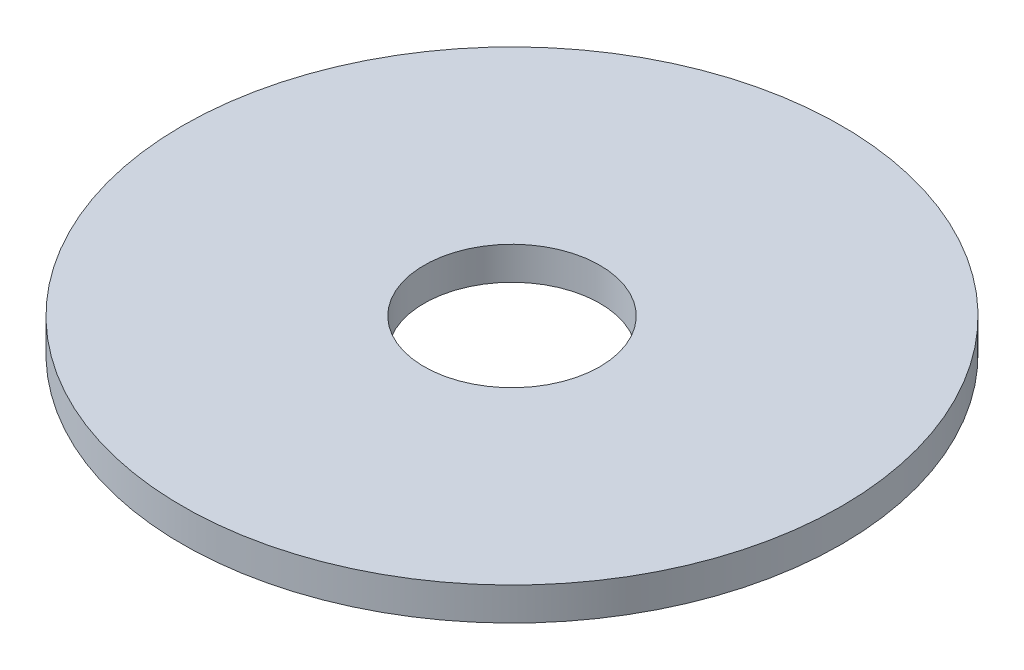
ISO-10303-21;
HEADER;
FILE_DESCRIPTION(('STEP AP214'),'2;1');
FILE_NAME('part.step','',(''),(''),'','','');
FILE_SCHEMA(('AUTOMOTIVE_DESIGN { 1 0 10303 214 1 1 1 1 }'));
ENDSEC;
DATA;
#1=APPLICATION_CONTEXT('core data for automotive mechanical design processes');
#2=APPLICATION_PROTOCOL_DEFINITION('international standard','automotive_design',2000,#1);
#3=PRODUCT_CONTEXT('',#1,'mechanical');
#4=PRODUCT('Part','Part','',(#3));
#5=PRODUCT_RELATED_PRODUCT_CATEGORY('part','',(#4));
#6=PRODUCT_DEFINITION_FORMATION('','',#4);
#7=PRODUCT_DEFINITION_CONTEXT('part definition',#1,'design');
#8=PRODUCT_DEFINITION('design','',#6,#7);
#9=PRODUCT_DEFINITION_SHAPE('','',#8);
#10=(LENGTH_UNIT() NAMED_UNIT(*) SI_UNIT(.MILLI.,.METRE.));
#11=(NAMED_UNIT(*) PLANE_ANGLE_UNIT() SI_UNIT($,.RADIAN.));
#12=(NAMED_UNIT(*) SI_UNIT($,.STERADIAN.) SOLID_ANGLE_UNIT());
#13=UNCERTAINTY_MEASURE_WITH_UNIT(LENGTH_MEASURE(1.E-05),#10,'distance_accuracy_value','');
#14=(GEOMETRIC_REPRESENTATION_CONTEXT(3) GLOBAL_UNCERTAINTY_ASSIGNED_CONTEXT((#13)) GLOBAL_UNIT_ASSIGNED_CONTEXT((#10,
#11,#12)) REPRESENTATION_CONTEXT('',''));
#15=CARTESIAN_POINT('',(0.,0.,0.));
#16=DIRECTION('',(0.,0.,1.));
#17=DIRECTION('',(1.,0.,0.));
#18=AXIS2_PLACEMENT_3D('',#15,#16,#17);
#19=CARTESIAN_POINT('',(-12.,0.,0.));
#20=DIRECTION('',(0.,-1.,0.));
#21=DIRECTION('',(1.,0.,0.));
#22=AXIS2_PLACEMENT_3D('',#19,#20,#21);
#23=PLANE('',#22);
#24=CARTESIAN_POINT('',(0.,0.,0.));
#25=DIRECTION('',(0.,-1.,0.));
#26=DIRECTION('',(1.,0.,0.));
#27=AXIS2_PLACEMENT_3D('',#24,#25,#26);
#28=CIRCLE('',#27,3.19999999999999);
#29=CARTESIAN_POINT('',(3.19999999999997,0.,0.));
#30=VERTEX_POINT('',#29);
#31=EDGE_CURVE('E17',#30,#30,#28,.F.);
#32=ORIENTED_EDGE('',*,*,#31,.T.);
#33=EDGE_LOOP('',(#32));
#34=FACE_BOUND('',#33,.T.);
#35=CARTESIAN_POINT('',(0.,0.,0.));
#36=DIRECTION('',(0.,-1.,0.));
#37=DIRECTION('',(1.,0.,0.));
#38=AXIS2_PLACEMENT_3D('',#35,#36,#37);
#39=CIRCLE('',#38,12.);
#40=CARTESIAN_POINT('',(12.,0.,0.));
#41=VERTEX_POINT('',#40);
#42=EDGE_CURVE('E26',#41,#41,#39,.F.);
#43=ORIENTED_EDGE('',*,*,#42,.F.);
#44=EDGE_LOOP('',(#43));
#45=FACE_BOUND('',#44,.T.);
#46=ADVANCED_FACE('F14',(#34,#45),#23,.T.);
#47=CARTESIAN_POINT('',(0.,-78.74,0.));
#48=DIRECTION('',(0.,-1.,0.));
#49=DIRECTION('',(1.,0.,0.));
#50=AXIS2_PLACEMENT_3D('',#47,#48,#49);
#51=CYLINDRICAL_SURFACE('',#50,3.19999999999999);
#52=ORIENTED_EDGE('',*,*,#31,.F.);
#53=EDGE_LOOP('',(#52));
#54=FACE_BOUND('',#53,.T.);
#55=CARTESIAN_POINT('',(0.,1.19999999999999,0.));
#56=DIRECTION('',(0.,-1.,0.));
#57=DIRECTION('',(1.,0.,0.));
#58=AXIS2_PLACEMENT_3D('',#55,#56,#57);
#59=CIRCLE('',#58,3.19999999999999);
#60=CARTESIAN_POINT('',(3.19999999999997,1.19999999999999,0.));
#61=VERTEX_POINT('',#60);
#62=EDGE_CURVE('E21',#61,#61,#59,.T.);
#63=ORIENTED_EDGE('',*,*,#62,.F.);
#64=EDGE_LOOP('',(#63));
#65=FACE_BOUND('',#64,.T.);
#66=ADVANCED_FACE('F36',(#54,#65),#51,.F.);
#67=CARTESIAN_POINT('',(0.,-78.74,0.));
#68=DIRECTION('',(0.,-1.,0.));
#69=DIRECTION('',(1.,0.,0.));
#70=AXIS2_PLACEMENT_3D('',#67,#68,#69);
#71=CYLINDRICAL_SURFACE('',#70,12.);
#72=CARTESIAN_POINT('',(0.,1.19999999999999,0.));
#73=DIRECTION('',(0.,-1.,0.));
#74=DIRECTION('',(1.,0.,0.));
#75=AXIS2_PLACEMENT_3D('',#72,#73,#74);
#76=CIRCLE('',#75,12.);
#77=CARTESIAN_POINT('',(12.,1.19999999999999,0.));
#78=VERTEX_POINT('',#77);
#79=EDGE_CURVE('E10',#78,#78,#76,.F.);
#80=ORIENTED_EDGE('',*,*,#79,.F.);
#81=EDGE_LOOP('',(#80));
#82=FACE_BOUND('',#81,.T.);
#83=ORIENTED_EDGE('',*,*,#42,.T.);
#84=EDGE_LOOP('',(#83));
#85=FACE_BOUND('',#84,.T.);
#86=ADVANCED_FACE('F39',(#82,#85),#71,.T.);
#87=CARTESIAN_POINT('',(-3.2,1.2,0.));
#88=DIRECTION('',(0.,1.,0.));
#89=DIRECTION('',(-1.,0.,0.));
#90=AXIS2_PLACEMENT_3D('',#87,#88,#89);
#91=PLANE('',#90);
#92=ORIENTED_EDGE('',*,*,#79,.T.);
#93=EDGE_LOOP('',(#92));
#94=FACE_BOUND('',#93,.T.);
#95=ORIENTED_EDGE('',*,*,#62,.T.);
#96=EDGE_LOOP('',(#95));
#97=FACE_BOUND('',#96,.T.);
#98=ADVANCED_FACE('F42',(#94,#97),#91,.T.);
#99=CLOSED_SHELL('',(#46,#66,#86,#98));
#100=MANIFOLD_SOLID_BREP('B1',#99);
#101=ADVANCED_BREP_SHAPE_REPRESENTATION('',(#18,#100),#14);
#102=SHAPE_DEFINITION_REPRESENTATION(#9,#101);
ENDSEC;
END-ISO-10303-21;
